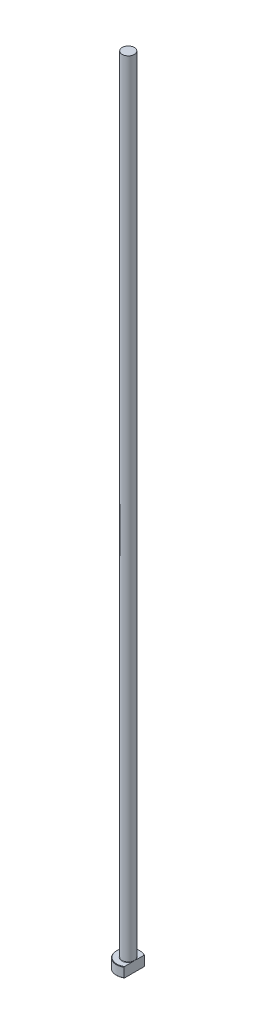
ISO-10303-21;
HEADER;
FILE_DESCRIPTION(('STEP AP214'),'2;1');
FILE_NAME('part.step','',(''),(''),'','','');
FILE_SCHEMA(('AUTOMOTIVE_DESIGN { 1 0 10303 214 1 1 1 1 }'));
ENDSEC;
DATA;
#1=APPLICATION_CONTEXT('core data for automotive mechanical design processes');
#2=APPLICATION_PROTOCOL_DEFINITION('international standard','automotive_design',2000,#1);
#3=PRODUCT_CONTEXT('',#1,'mechanical');
#4=PRODUCT('Part','Part','',(#3));
#5=PRODUCT_RELATED_PRODUCT_CATEGORY('part','',(#4));
#6=PRODUCT_DEFINITION_FORMATION('','',#4);
#7=PRODUCT_DEFINITION_CONTEXT('part definition',#1,'design');
#8=PRODUCT_DEFINITION('design','',#6,#7);
#9=PRODUCT_DEFINITION_SHAPE('','',#8);
#10=(LENGTH_UNIT() NAMED_UNIT(*) SI_UNIT(.MILLI.,.METRE.));
#11=(NAMED_UNIT(*) PLANE_ANGLE_UNIT() SI_UNIT($,.RADIAN.));
#12=(NAMED_UNIT(*) SI_UNIT($,.STERADIAN.) SOLID_ANGLE_UNIT());
#13=UNCERTAINTY_MEASURE_WITH_UNIT(LENGTH_MEASURE(1.E-05),#10,'distance_accuracy_value','');
#14=(GEOMETRIC_REPRESENTATION_CONTEXT(3) GLOBAL_UNCERTAINTY_ASSIGNED_CONTEXT((#13)) GLOBAL_UNIT_ASSIGNED_CONTEXT((#10,
#11,#12)) REPRESENTATION_CONTEXT('',''));
#15=CARTESIAN_POINT('',(0.,0.,0.));
#16=DIRECTION('',(0.,0.,1.));
#17=DIRECTION('',(1.,0.,0.));
#18=AXIS2_PLACEMENT_3D('',#15,#16,#17);
#19=CARTESIAN_POINT('',(0.,0.,0.));
#20=DIRECTION('',(0.,-1.,0.));
#21=DIRECTION('',(0.,0.,-1.));
#22=AXIS2_PLACEMENT_3D('',#19,#20,#21);
#23=PLANE('',#22);
#24=CARTESIAN_POINT('',(0.,0.,0.));
#25=DIRECTION('',(0.,-1.,0.));
#26=DIRECTION('',(0.,0.,-1.));
#27=AXIS2_PLACEMENT_3D('',#24,#25,#26);
#28=CIRCLE('',#27,5.79999999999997);
#29=CARTESIAN_POINT('',(3.04999999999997,0.,4.93330518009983));
#30=VERTEX_POINT('',#29);
#31=CARTESIAN_POINT('',(3.04999999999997,0.,-4.93330518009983));
#32=VERTEX_POINT('',#31);
#33=EDGE_CURVE('E98',#30,#32,#28,.T.);
#34=ORIENTED_EDGE('',*,*,#33,.T.);
#35=DIRECTION('',(0.,0.,1.));
#36=VECTOR('',#35,1.);
#37=CARTESIAN_POINT('',(3.04999999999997,0.,-5.16696235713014));
#38=LINE('',#37,#36);
#39=EDGE_CURVE('E83',#32,#30,#38,.T.);
#40=ORIENTED_EDGE('',*,*,#39,.T.);
#41=EDGE_LOOP('',(#34,#40));
#42=FACE_BOUND('',#41,.T.);
#43=ADVANCED_FACE('F32',(#42),#23,.T.);
#44=CARTESIAN_POINT('',(0.,259.958771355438,0.));
#45=DIRECTION('',(0.,1.,0.));
#46=DIRECTION('',(0.,0.,1.));
#47=AXIS2_PLACEMENT_3D('',#44,#45,#46);
#48=CYLINDRICAL_SURFACE('',#47,5.99999999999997);
#49=CARTESIAN_POINT('',(0.,4.80000000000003,0.));
#50=DIRECTION('',(0.,1.,0.));
#51=DIRECTION('',(0.,0.,1.));
#52=AXIS2_PLACEMENT_3D('',#49,#50,#51);
#53=CIRCLE('',#52,5.99999999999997);
#54=CARTESIAN_POINT('',(3.04999999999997,4.80000000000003,5.16696235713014));
#55=VERTEX_POINT('',#54);
#56=CARTESIAN_POINT('',(3.04999999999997,4.80000000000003,-5.16696235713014));
#57=VERTEX_POINT('',#56);
#58=EDGE_CURVE('E104',#55,#57,#53,.F.);
#59=ORIENTED_EDGE('',*,*,#58,.T.);
#60=DIRECTION('',(0.,-1.,0.));
#61=VECTOR('',#60,1.);
#62=CARTESIAN_POINT('',(3.04999999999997,400.,-5.16696235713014));
#63=LINE('',#62,#61);
#64=CARTESIAN_POINT('',(3.04999999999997,0.199999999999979,-5.16696235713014));
#65=VERTEX_POINT('',#64);
#66=EDGE_CURVE('E183',#57,#65,#63,.T.);
#67=ORIENTED_EDGE('',*,*,#66,.T.);
#68=CARTESIAN_POINT('',(0.,0.199999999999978,0.));
#69=DIRECTION('',(0.,-1.,0.));
#70=DIRECTION('',(0.,0.,-1.));
#71=AXIS2_PLACEMENT_3D('',#68,#69,#70);
#72=CIRCLE('',#71,5.99999999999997);
#73=CARTESIAN_POINT('',(3.04999999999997,0.199999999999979,5.16696235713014));
#74=VERTEX_POINT('',#73);
#75=EDGE_CURVE('E100',#65,#74,#72,.F.);
#76=ORIENTED_EDGE('',*,*,#75,.T.);
#77=DIRECTION('',(0.,-1.,0.));
#78=VECTOR('',#77,1.);
#79=CARTESIAN_POINT('',(3.04999999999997,400.,5.16696235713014));
#80=LINE('',#79,#78);
#81=EDGE_CURVE('E93',#55,#74,#80,.T.);
#82=ORIENTED_EDGE('',*,*,#81,.F.);
#83=EDGE_LOOP('',(#59,#67,#76,#82));
#84=FACE_BOUND('',#83,.T.);
#85=ADVANCED_FACE('F158',(#84),#48,.T.);
#86=CARTESIAN_POINT('',(-5.99999999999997,5.,0.));
#87=DIRECTION('',(0.,1.,0.));
#88=DIRECTION('',(0.,0.,1.));
#89=AXIS2_PLACEMENT_3D('',#86,#87,#88);
#90=PLANE('',#89);
#91=CARTESIAN_POINT('',(0.,5.,0.));
#92=DIRECTION('',(0.,1.,0.));
#93=DIRECTION('',(0.,0.,1.));
#94=AXIS2_PLACEMENT_3D('',#91,#92,#93);
#95=CIRCLE('',#94,5.79999999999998);
#96=CARTESIAN_POINT('',(3.04999999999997,5.,-4.93330518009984));
#97=VERTEX_POINT('',#96);
#98=CARTESIAN_POINT('',(3.04999999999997,5.,4.93330518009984));
#99=VERTEX_POINT('',#98);
#100=EDGE_CURVE('E178',#97,#99,#95,.T.);
#101=ORIENTED_EDGE('',*,*,#100,.T.);
#102=DIRECTION('',(0.,0.,-1.));
#103=VECTOR('',#102,1.);
#104=CARTESIAN_POINT('',(3.04999999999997,5.,0.));
#105=LINE('',#104,#103);
#106=CARTESIAN_POINT('',(3.04999999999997,4.99999999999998,1.12249721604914));
#107=VERTEX_POINT('',#106);
#108=EDGE_CURVE('E57',#99,#107,#105,.T.);
#109=ORIENTED_EDGE('',*,*,#108,.T.);
#110=CARTESIAN_POINT('',(0.,5.,0.));
#111=DIRECTION('',(0.,1.,0.));
#112=DIRECTION('',(0.,0.,1.));
#113=AXIS2_PLACEMENT_3D('',#110,#111,#112);
#114=CIRCLE('',#113,3.24999999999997);
#115=CARTESIAN_POINT('',(3.04999999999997,4.99999999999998,-1.12249721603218));
#116=VERTEX_POINT('',#115);
#117=EDGE_CURVE('E107',#107,#116,#114,.F.);
#118=ORIENTED_EDGE('',*,*,#117,.T.);
#119=EDGE_CURVE('E136',#116,#97,#105,.T.);
#120=ORIENTED_EDGE('',*,*,#119,.T.);
#121=EDGE_LOOP('',(#101,#109,#118,#120));
#122=FACE_BOUND('',#121,.T.);
#123=ADVANCED_FACE('F147',(#122),#90,.T.);
#124=CARTESIAN_POINT('',(0.,5.,0.));
#125=DIRECTION('',(0.,-1.,0.));
#126=DIRECTION('',(0.,0.,-1.));
#127=AXIS2_PLACEMENT_3D('',#124,#125,#126);
#128=CONICAL_SURFACE('',#127,5.79999999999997,0.785398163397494);
#129=ORIENTED_EDGE('',*,*,#58,.F.);
#130=CARTESIAN_POINT('',(3.04999999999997,-0.970698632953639,11.3686783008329));
#131=CARTESIAN_POINT('',(3.04999999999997,-0.729844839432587,11.1192942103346));
#132=CARTESIAN_POINT('',(3.04999999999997,-0.489253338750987,10.8696559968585));
#133=CARTESIAN_POINT('',(3.04999999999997,-0.00874272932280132,10.3697279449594));
#134=CARTESIAN_POINT('',(3.04999999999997,0.231176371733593,10.1194380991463));
#135=CARTESIAN_POINT('',(3.04999999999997,0.71029504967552,9.61795795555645));
#136=CARTESIAN_POINT('',(3.04999999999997,0.949494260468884,9.36676730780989));
#137=CARTESIAN_POINT('',(3.04999999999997,1.42684960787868,8.86339876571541));
#138=CARTESIAN_POINT('',(3.04999999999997,1.66500575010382,8.61122087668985));
#139=CARTESIAN_POINT('',(3.04999999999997,2.13559657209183,8.1102790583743));
#140=CARTESIAN_POINT('',(3.04999999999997,2.36805568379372,7.86153809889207));
#141=CARTESIAN_POINT('',(3.04999999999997,2.83129526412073,7.36249846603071));
#142=CARTESIAN_POINT('',(3.04999999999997,3.0620757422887,7.11219980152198));
#143=CARTESIAN_POINT('',(3.04999999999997,3.52134632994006,6.60959354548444));
#144=CARTESIAN_POINT('',(3.04999999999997,3.74983686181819,6.35728634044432));
#145=CARTESIAN_POINT('',(3.04999999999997,4.20371775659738,5.84990299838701));
#146=CARTESIAN_POINT('',(3.04999999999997,4.42910822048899,5.5948269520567));
#147=CARTESIAN_POINT('',(3.04999999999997,4.79887807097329,5.16894007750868));
#148=CARTESIAN_POINT('',(3.04999999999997,4.94452846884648,4.99923427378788));
#149=CARTESIAN_POINT('',(3.04999999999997,5.23331494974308,4.65766279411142));
#150=CARTESIAN_POINT('',(3.04999999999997,5.37645078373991,4.48579690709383));
#151=CARTESIAN_POINT('',(3.04999999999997,5.6607909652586,4.1375355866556));
#152=CARTESIAN_POINT('',(3.04999999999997,5.80196080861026,3.96111185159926));
#153=CARTESIAN_POINT('',(3.04999999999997,6.07950752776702,3.60459087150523));
#154=CARTESIAN_POINT('',(3.04999999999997,6.21588558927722,3.42449455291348));
#155=CARTESIAN_POINT('',(3.04999999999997,6.48382052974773,3.05665019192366));
#156=CARTESIAN_POINT('',(3.04999999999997,6.61527833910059,2.86882893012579));
#157=CARTESIAN_POINT('',(3.04999999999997,6.8046656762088,2.58172885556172));
#158=CARTESIAN_POINT('',(3.04999999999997,6.86653995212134,2.48505688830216));
#159=CARTESIAN_POINT('',(3.04999999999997,6.98697221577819,2.28967595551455));
#160=CARTESIAN_POINT('',(3.04999999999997,7.04553056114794,2.19096721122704));
#161=CARTESIAN_POINT('',(3.04999999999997,7.1578414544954,1.99234566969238));
#162=CARTESIAN_POINT('',(3.04999999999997,7.21164228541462,1.89246054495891));
#163=CARTESIAN_POINT('',(3.04999999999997,7.31412145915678,1.69011096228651));
#164=CARTESIAN_POINT('',(3.04999999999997,7.36279884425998,1.58764602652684));
#165=CARTESIAN_POINT('',(3.04999999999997,7.498910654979,1.27646394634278));
#166=CARTESIAN_POINT('',(3.04999999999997,7.57686498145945,1.06321933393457));
#167=CARTESIAN_POINT('',(3.04999999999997,7.66214701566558,0.74370706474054));
#168=CARTESIAN_POINT('',(3.04999999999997,7.68491750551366,0.641524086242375));
#169=CARTESIAN_POINT('',(3.04999999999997,7.72074349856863,0.435432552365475));
#170=CARTESIAN_POINT('',(3.04999999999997,7.73379998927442,0.331524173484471));
#171=CARTESIAN_POINT('',(3.04999999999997,7.74926869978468,0.123282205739));
#172=CARTESIAN_POINT('',(3.04999999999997,7.75171909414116,0.0189514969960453));
#173=CARTESIAN_POINT('',(3.04999999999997,7.7458996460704,-0.189412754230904));
#174=CARTESIAN_POINT('',(3.04999999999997,7.73762904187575,-0.293446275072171));
#175=CARTESIAN_POINT('',(3.04999999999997,7.71106535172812,-0.499372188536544));
#176=CARTESIAN_POINT('',(3.04999999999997,7.6928510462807,-0.60127495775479));
#177=CARTESIAN_POINT('',(3.04999999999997,7.64758004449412,-0.803076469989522));
#178=CARTESIAN_POINT('',(3.04999999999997,7.62052218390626,-0.902974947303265));
#179=CARTESIAN_POINT('',(3.04999999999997,7.55873377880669,-1.10100969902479));
#180=CARTESIAN_POINT('',(3.04999999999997,7.52395724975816,-1.19913143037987));
#181=CARTESIAN_POINT('',(3.04999999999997,7.44818034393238,-1.39288710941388));
#182=CARTESIAN_POINT('',(3.04999999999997,7.40718118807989,-1.48852154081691));
#183=CARTESIAN_POINT('',(3.04999999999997,7.27880199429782,-1.76725558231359));
#184=CARTESIAN_POINT('',(3.04999999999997,7.18437453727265,-1.94709912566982));
#185=CARTESIAN_POINT('',(3.04999999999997,6.9829288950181,-2.29966178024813));
#186=CARTESIAN_POINT('',(3.04999999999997,6.87589523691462,-2.47237177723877));
#187=CARTESIAN_POINT('',(3.04999999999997,6.65293850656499,-2.81286471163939));
#188=CARTESIAN_POINT('',(3.04999999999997,6.53698257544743,-2.9806259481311));
#189=CARTESIAN_POINT('',(3.04999999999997,6.29920889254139,-3.31177740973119));
#190=CARTESIAN_POINT('',(3.04999999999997,6.17739401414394,-3.47516971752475));
#191=CARTESIAN_POINT('',(3.04999999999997,5.9279048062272,-3.80077365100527));
#192=CARTESIAN_POINT('',(3.04999999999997,5.80017502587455,-3.96294258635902));
#193=CARTESIAN_POINT('',(3.04999999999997,5.54148279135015,-4.28469855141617));
#194=CARTESIAN_POINT('',(3.04999999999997,5.41052000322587,-4.44428531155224));
#195=CARTESIAN_POINT('',(3.04999999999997,5.14647056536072,-4.76104235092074));
#196=CARTESIAN_POINT('',(3.04999999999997,5.01338972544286,-4.91821748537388));
#197=CARTESIAN_POINT('',(3.04999999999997,4.74534141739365,-5.23095234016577));
#198=CARTESIAN_POINT('',(3.04999999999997,4.61037391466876,-5.3865120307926));
#199=CARTESIAN_POINT('',(3.04999999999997,4.25119607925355,-5.7965100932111));
#200=CARTESIAN_POINT('',(3.04999999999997,4.02571738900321,-6.04983649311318));
#201=CARTESIAN_POINT('',(3.04999999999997,3.57194090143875,-6.55395552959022));
#202=CARTESIAN_POINT('',(3.04999999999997,3.34364302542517,-6.80474809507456));
#203=CARTESIAN_POINT('',(3.04999999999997,2.88477169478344,-7.30466840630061));
#204=CARTESIAN_POINT('',(3.04999999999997,2.65419632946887,-7.55379439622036));
#205=CARTESIAN_POINT('',(3.04999999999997,2.19148976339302,-8.05059711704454));
#206=CARTESIAN_POINT('',(3.04999999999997,1.9593585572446,-8.29827384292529));
#207=CARTESIAN_POINT('',(3.04999999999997,1.50341144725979,-8.78239136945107));
#208=CARTESIAN_POINT('',(3.04999999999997,1.27964364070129,-9.01887750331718));
#209=CARTESIAN_POINT('',(3.04999999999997,0.831227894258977,-9.49101521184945));
#210=CARTESIAN_POINT('',(3.04999999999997,0.606579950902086,-9.72666678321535));
#211=CARTESIAN_POINT('',(3.04999999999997,0.156823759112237,-10.1970312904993));
#212=CARTESIAN_POINT('',(3.04999999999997,-0.0682837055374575,-10.431744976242));
#213=CARTESIAN_POINT('',(3.04999999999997,-0.519082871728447,-10.9006068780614));
#214=CARTESIAN_POINT('',(3.04999999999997,-0.744774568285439,-11.1347550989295));
#215=CARTESIAN_POINT('',(3.04999999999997,-0.970698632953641,-11.3686783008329));
#216=B_SPLINE_CURVE_WITH_KNOTS('',3,(#130,#131,#132,#133,#134,#135,#136,#137,#138,#139,#140,
#141,#142,#143,#144,#145,#146,#147,#148,#149,#150,#151,#152,#153,#154,#155,#156,#157,#158,#159,
#160,#161,#162,#163,#164,#165,#166,#167,#168,#169,#170,#171,#172,#173,#174,#175,#176,#177,#178,
#179,#180,#181,#182,#183,#184,#185,#186,#187,#188,#189,#190,#191,#192,#193,#194,#195,#196,#197,
#198,#199,#200,#201,#202,#203,#204,#205,#206,#207,#208,#209,#210,#211,#212,#213,#214,#215),
.UNSPECIFIED.,.F.,.F.,(4,2,2,2,2,2,2,2,2,2,2,2,2,2,2,2,2,2,2,2,2,2,2,2,2,2,2,2,2,2,2,2,2,2,2,2,
2,2,2,2,2,2,4),(0.,1.04010969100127,2.08023122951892,3.120813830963,4.16139083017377,
5.1827488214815,6.20410100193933,7.22526118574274,8.24638802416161,8.9172846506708,
9.58824734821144,10.2660415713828,10.9436668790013,11.6311554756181,11.9754354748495,
12.3196782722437,12.6598862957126,13.0001578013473,13.6781281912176,13.9918165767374,
14.3054730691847,14.6179996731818,14.9305484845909,15.2406562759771,15.5508049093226,
15.8628533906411,16.1748407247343,16.7833414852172,17.3925970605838,18.0042149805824,
18.6155359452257,19.2347734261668,19.8540751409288,20.4718999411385,21.0897360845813,
22.1071178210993,23.1245280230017,24.1428799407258,25.1612353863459,26.137951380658,
27.1146712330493,28.0903109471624,29.0659423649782),.UNSPECIFIED.);
#217=EDGE_CURVE('E135',#55,#99,#216,.T.);
#218=ORIENTED_EDGE('',*,*,#217,.T.);
#219=ORIENTED_EDGE('',*,*,#100,.F.);
#220=EDGE_CURVE('E127',#97,#57,#216,.T.);
#221=ORIENTED_EDGE('',*,*,#220,.T.);
#222=EDGE_LOOP('',(#129,#218,#219,#221));
#223=FACE_BOUND('',#222,.T.);
#224=ADVANCED_FACE('F143',(#223),#128,.T.);
#225=CARTESIAN_POINT('',(0.,0.199999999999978,0.));
#226=DIRECTION('',(0.,1.,0.));
#227=DIRECTION('',(0.,0.,1.));
#228=AXIS2_PLACEMENT_3D('',#225,#226,#227);
#229=CONICAL_SURFACE('',#228,5.99999999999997,0.785398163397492);
#230=ORIENTED_EDGE('',*,*,#75,.F.);
#231=CARTESIAN_POINT('',(3.04999999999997,5.97069863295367,-11.3686783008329));
#232=CARTESIAN_POINT('',(3.04999999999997,5.72984483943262,-11.1192942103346));
#233=CARTESIAN_POINT('',(3.04999999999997,5.48925333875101,-10.8696559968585));
#234=CARTESIAN_POINT('',(3.04999999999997,5.00874272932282,-10.3697279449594));
#235=CARTESIAN_POINT('',(3.04999999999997,4.76882362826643,-10.1194380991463));
#236=CARTESIAN_POINT('',(3.04999999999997,4.28970495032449,-9.61795795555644));
#237=CARTESIAN_POINT('',(3.04999999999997,4.05050573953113,-9.36676730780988));
#238=CARTESIAN_POINT('',(3.04999999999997,3.57315039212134,-8.8633987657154));
#239=CARTESIAN_POINT('',(3.04999999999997,3.33499424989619,-8.61122087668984));
#240=CARTESIAN_POINT('',(3.04999999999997,2.86440342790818,-8.11027905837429));
#241=CARTESIAN_POINT('',(3.04999999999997,2.63194431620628,-7.86153809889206));
#242=CARTESIAN_POINT('',(3.04999999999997,2.16870473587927,-7.36249846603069));
#243=CARTESIAN_POINT('',(3.04999999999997,1.9379242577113,-7.11219980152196));
#244=CARTESIAN_POINT('',(3.04999999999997,1.47865367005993,-6.60959354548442));
#245=CARTESIAN_POINT('',(3.04999999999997,1.25016313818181,-6.3572863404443));
#246=CARTESIAN_POINT('',(3.04999999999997,0.796282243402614,-5.84990299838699));
#247=CARTESIAN_POINT('',(3.04999999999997,0.570891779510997,-5.59482695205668));
#248=CARTESIAN_POINT('',(3.04999999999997,0.201121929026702,-5.16894007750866));
#249=CARTESIAN_POINT('',(3.04999999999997,0.0554715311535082,-4.99923427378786));
#250=CARTESIAN_POINT('',(3.04999999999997,-0.233314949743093,-4.65766279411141));
#251=CARTESIAN_POINT('',(3.04999999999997,-0.376450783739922,-4.48579690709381));
#252=CARTESIAN_POINT('',(3.04999999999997,-0.660790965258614,-4.13753558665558));
#253=CARTESIAN_POINT('',(3.04999999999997,-0.801960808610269,-3.96111185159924));
#254=CARTESIAN_POINT('',(3.04999999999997,-1.07950752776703,-3.60459087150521));
#255=CARTESIAN_POINT('',(3.04999999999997,-1.21588558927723,-3.42449455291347));
#256=CARTESIAN_POINT('',(3.04999999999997,-1.48382052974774,-3.05665019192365));
#257=CARTESIAN_POINT('',(3.04999999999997,-1.6152783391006,-2.86882893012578));
#258=CARTESIAN_POINT('',(3.04999999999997,-1.80466567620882,-2.58172885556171));
#259=CARTESIAN_POINT('',(3.04999999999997,-1.86653995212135,-2.48505688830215));
#260=CARTESIAN_POINT('',(3.04999999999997,-1.9869722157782,-2.28967595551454));
#261=CARTESIAN_POINT('',(3.04999999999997,-2.04553056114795,-2.19096721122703));
#262=CARTESIAN_POINT('',(3.04999999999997,-2.15784145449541,-1.99234566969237));
#263=CARTESIAN_POINT('',(3.04999999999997,-2.21164228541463,-1.8924605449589));
#264=CARTESIAN_POINT('',(3.04999999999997,-2.31412145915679,-1.6901109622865));
#265=CARTESIAN_POINT('',(3.04999999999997,-2.36279884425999,-1.58764602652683));
#266=CARTESIAN_POINT('',(3.04999999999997,-2.49891065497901,-1.27646394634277));
#267=CARTESIAN_POINT('',(3.04999999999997,-2.57686498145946,-1.06321933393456));
#268=CARTESIAN_POINT('',(3.04999999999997,-2.66214701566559,-0.743707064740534));
#269=CARTESIAN_POINT('',(3.04999999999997,-2.68491750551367,-0.641524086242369));
#270=CARTESIAN_POINT('',(3.04999999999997,-2.72074349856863,-0.43543255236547));
#271=CARTESIAN_POINT('',(3.04999999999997,-2.73379998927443,-0.331524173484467));
#272=CARTESIAN_POINT('',(3.04999999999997,-2.74926869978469,-0.123282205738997));
#273=CARTESIAN_POINT('',(3.04999999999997,-2.75171909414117,-0.0189514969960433));
#274=CARTESIAN_POINT('',(3.04999999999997,-2.74589964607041,0.189412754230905));
#275=CARTESIAN_POINT('',(3.04999999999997,-2.73762904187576,0.293446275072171));
#276=CARTESIAN_POINT('',(3.04999999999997,-2.71106535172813,0.499372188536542));
#277=CARTESIAN_POINT('',(3.04999999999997,-2.69285104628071,0.601274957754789));
#278=CARTESIAN_POINT('',(3.04999999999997,-2.64758004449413,0.803076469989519));
#279=CARTESIAN_POINT('',(3.04999999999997,-2.62052218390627,0.902974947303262));
#280=CARTESIAN_POINT('',(3.04999999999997,-2.5587337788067,1.10100969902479));
#281=CARTESIAN_POINT('',(3.04999999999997,-2.52395724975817,1.19913143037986));
#282=CARTESIAN_POINT('',(3.04999999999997,-2.44818034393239,1.39288710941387));
#283=CARTESIAN_POINT('',(3.04999999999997,-2.4071811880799,1.4885215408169));
#284=CARTESIAN_POINT('',(3.04999999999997,-2.27880199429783,1.76725558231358));
#285=CARTESIAN_POINT('',(3.04999999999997,-2.18437453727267,1.9470991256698));
#286=CARTESIAN_POINT('',(3.04999999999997,-1.98292889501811,2.29966178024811));
#287=CARTESIAN_POINT('',(3.04999999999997,-1.87589523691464,2.47237177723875));
#288=CARTESIAN_POINT('',(3.04999999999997,-1.65293850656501,2.81286471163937));
#289=CARTESIAN_POINT('',(3.04999999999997,-1.53698257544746,2.98062594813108));
#290=CARTESIAN_POINT('',(3.04999999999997,-1.29920889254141,3.31177740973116));
#291=CARTESIAN_POINT('',(3.04999999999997,-1.17739401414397,3.47516971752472));
#292=CARTESIAN_POINT('',(3.04999999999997,-0.927904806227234,3.80077365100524));
#293=CARTESIAN_POINT('',(3.04999999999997,-0.800175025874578,3.96294258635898));
#294=CARTESIAN_POINT('',(3.04999999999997,-0.541482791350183,4.28469855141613));
#295=CARTESIAN_POINT('',(3.04999999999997,-0.410520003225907,4.4442853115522));
#296=CARTESIAN_POINT('',(3.04999999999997,-0.146470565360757,4.76104235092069));
#297=CARTESIAN_POINT('',(3.04999999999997,-0.0133897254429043,4.91821748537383));
#298=CARTESIAN_POINT('',(3.04999999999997,0.254658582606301,5.23095234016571));
#299=CARTESIAN_POINT('',(3.04999999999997,0.389626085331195,5.38651203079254));
#300=CARTESIAN_POINT('',(3.04999999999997,0.748803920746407,5.79651009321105));
#301=CARTESIAN_POINT('',(3.04999999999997,0.97428261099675,6.04983649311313));
#302=CARTESIAN_POINT('',(3.04999999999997,1.42805909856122,6.55395552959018));
#303=CARTESIAN_POINT('',(3.04999999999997,1.6563569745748,6.80474809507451));
#304=CARTESIAN_POINT('',(3.04999999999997,2.11522830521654,7.30466840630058));
#305=CARTESIAN_POINT('',(3.04999999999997,2.34580367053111,7.55379439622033));
#306=CARTESIAN_POINT('',(3.04999999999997,2.80851023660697,8.05059711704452));
#307=CARTESIAN_POINT('',(3.04999999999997,3.0406414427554,8.29827384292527));
#308=CARTESIAN_POINT('',(3.04999999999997,3.49658855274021,8.78239136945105));
#309=CARTESIAN_POINT('',(3.04999999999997,3.72035635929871,9.01887750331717));
#310=CARTESIAN_POINT('',(3.04999999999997,4.16877210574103,9.49101521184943));
#311=CARTESIAN_POINT('',(3.04999999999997,4.39342004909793,9.72666678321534));
#312=CARTESIAN_POINT('',(3.04999999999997,4.84317624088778,10.1970312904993));
#313=CARTESIAN_POINT('',(3.04999999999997,5.06828370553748,10.431744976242));
#314=CARTESIAN_POINT('',(3.04999999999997,5.51908287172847,10.9006068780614));
#315=CARTESIAN_POINT('',(3.04999999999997,5.74477456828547,11.1347550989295));
#316=CARTESIAN_POINT('',(3.04999999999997,5.97069863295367,11.3686783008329));
#317=B_SPLINE_CURVE_WITH_KNOTS('',3,(#231,#232,#233,#234,#235,#236,#237,#238,#239,#240,#241,
#242,#243,#244,#245,#246,#247,#248,#249,#250,#251,#252,#253,#254,#255,#256,#257,#258,#259,#260,
#261,#262,#263,#264,#265,#266,#267,#268,#269,#270,#271,#272,#273,#274,#275,#276,#277,#278,#279,
#280,#281,#282,#283,#284,#285,#286,#287,#288,#289,#290,#291,#292,#293,#294,#295,#296,#297,#298,
#299,#300,#301,#302,#303,#304,#305,#306,#307,#308,#309,#310,#311,#312,#313,#314,#315,#316),
.UNSPECIFIED.,.F.,.F.,(4,2,2,2,2,2,2,2,2,2,2,2,2,2,2,2,2,2,2,2,2,2,2,2,2,2,2,2,2,2,2,2,2,2,2,2,
2,2,2,2,2,2,4),(0.,1.04010969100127,2.08023122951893,3.12081383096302,4.1613908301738,
5.18274882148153,6.20410100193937,7.22526118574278,8.24638802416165,8.91728465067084,
9.58824734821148,10.2660415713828,10.9436668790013,11.6311554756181,11.9754354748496,
12.3196782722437,12.6598862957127,13.0001578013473,13.6781281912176,13.9918165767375,
14.3054730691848,14.6179996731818,14.930548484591,15.2406562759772,15.5508049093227,
15.8628533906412,16.1748407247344,16.7833414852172,17.3925970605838,18.0042149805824,
18.6155359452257,19.2347734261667,19.8540751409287,20.4718999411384,21.0897360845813,
22.1071178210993,23.1245280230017,24.1428799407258,25.1612353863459,26.137951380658,
27.1146712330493,28.0903109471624,29.0659423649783),.UNSPECIFIED.);
#318=EDGE_CURVE('E86',#65,#32,#317,.T.);
#319=ORIENTED_EDGE('',*,*,#318,.T.);
#320=ORIENTED_EDGE('',*,*,#33,.F.);
#321=EDGE_CURVE('E89',#30,#74,#317,.T.);
#322=ORIENTED_EDGE('',*,*,#321,.T.);
#323=EDGE_LOOP('',(#230,#319,#320,#322));
#324=FACE_BOUND('',#323,.T.);
#325=ADVANCED_FACE('F97',(#324),#229,.T.);
#326=CARTESIAN_POINT('',(0.,5.19999999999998,0.));
#327=DIRECTION('',(0.,1.,0.));
#328=DIRECTION('',(0.,0.,1.));
#329=AXIS2_PLACEMENT_3D('',#326,#327,#328);
#330=TOROIDAL_SURFACE('',#329,3.24999999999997,0.2);
#331=CARTESIAN_POINT('',(3.04999999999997,5.19999999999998,0.));
#332=CARTESIAN_POINT('',(3.04999999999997,5.20000050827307,1.21234498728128E-10));
#333=CARTESIAN_POINT('',(3.04999999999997,5.2000010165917,-1.94554167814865E-07));
#334=CARTESIAN_POINT('',(3.04999999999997,5.20000196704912,-7.36231908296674E-07));
#335=CARTESIAN_POINT('',(3.04999999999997,5.20000239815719,-1.09605845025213E-06));
#336=CARTESIAN_POINT('',(3.04999999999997,5.20000329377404,-1.95768484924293E-06));
#337=CARTESIAN_POINT('',(3.04999999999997,5.20000374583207,-2.47339958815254E-06));
#338=CARTESIAN_POINT('',(3.04999999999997,5.20000455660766,-3.54344299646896E-06));
#339=CARTESIAN_POINT('',(3.04999999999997,5.20000491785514,-4.0960013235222E-06));
#340=CARTESIAN_POINT('',(3.04999999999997,5.20000625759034,-6.23288240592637E-06));
#341=CARTESIAN_POINT('',(3.04999999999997,5.20000716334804,-7.86540857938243E-06));
#342=CARTESIAN_POINT('',(3.04999999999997,5.20000865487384,-1.11012618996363E-05));
#343=CARTESIAN_POINT('',(3.04999999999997,5.20000926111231,-1.26955485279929E-05));
#344=CARTESIAN_POINT('',(3.04999999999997,5.20001180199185,-1.94350330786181E-05));
#345=CARTESIAN_POINT('',(3.04999999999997,5.20001369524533,-2.45990996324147E-05));
#346=CARTESIAN_POINT('',(3.04999999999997,5.20001648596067,-3.43608245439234E-05));
#347=CARTESIAN_POINT('',(3.04999999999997,5.20001748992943,-3.892785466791E-05));
#348=CARTESIAN_POINT('',(3.04999999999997,5.20002479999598,-7.28490938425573E-05));
#349=CARTESIAN_POINT('',(3.04999999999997,5.20003033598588,-0.000102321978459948));
#350=CARTESIAN_POINT('',(3.04999999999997,5.2000545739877,-0.000218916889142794));
#351=CARTESIAN_POINT('',(3.04999999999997,5.20007771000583,-0.000305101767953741));
#352=CARTESIAN_POINT('',(3.04999999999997,5.20016793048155,-0.000646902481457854));
#353=CARTESIAN_POINT('',(3.04999999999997,5.20023214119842,-0.00090303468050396));
#354=CARTESIAN_POINT('',(3.04999999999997,5.20048959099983,-0.00192235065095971));
#355=CARTESIAN_POINT('',(3.04999999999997,5.200686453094,-0.00268486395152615));
#356=CARTESIAN_POINT('',(3.04999999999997,5.20150513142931,-0.0058644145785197));
#357=CARTESIAN_POINT('',(3.04999999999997,5.20212238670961,-0.00828229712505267));
#358=CARTESIAN_POINT('',(3.04999999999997,5.20733075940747,-0.0286735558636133));
#359=CARTESIAN_POINT('',(3.04999999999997,5.21193872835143,-0.0466439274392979));
#360=CARTESIAN_POINT('',(3.04999999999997,5.22094200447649,-0.0818758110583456));
#361=CARTESIAN_POINT('',(3.04999999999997,5.22533847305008,-0.0991370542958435));
#362=CARTESIAN_POINT('',(3.04999999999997,5.23964641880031,-0.155525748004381));
#363=CARTESIAN_POINT('',(3.04999999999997,5.24949334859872,-0.194669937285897));
#364=CARTESIAN_POINT('',(3.04999999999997,5.26604342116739,-0.261710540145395));
#365=CARTESIAN_POINT('',(3.04999999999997,5.27283214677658,-0.289585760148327));
#366=CARTESIAN_POINT('',(3.04999999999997,5.28599220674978,-0.344649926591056));
#367=CARTESIAN_POINT('',(3.04999999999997,5.29236984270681,-0.371837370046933));
#368=CARTESIAN_POINT('',(3.04999999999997,5.31157589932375,-0.455723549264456));
#369=CARTESIAN_POINT('',(3.04999999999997,5.32392035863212,-0.512535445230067));
#370=CARTESIAN_POINT('',(3.04999999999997,5.34680977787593,-0.627095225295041));
#371=CARTESIAN_POINT('',(3.04999999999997,5.35733631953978,-0.684846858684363));
#372=CARTESIAN_POINT('',(3.04999999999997,5.37641100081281,-0.805890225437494));
#373=CARTESIAN_POINT('',(3.04999999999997,5.38470472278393,-0.869223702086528));
#374=CARTESIAN_POINT('',(3.04999999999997,5.39650442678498,-0.996147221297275));
#375=CARTESIAN_POINT('',(3.04999999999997,5.40002782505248,-1.05973547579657));
#376=CARTESIAN_POINT('',(3.04999999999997,5.39997784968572,-1.17309949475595));
#377=CARTESIAN_POINT('',(3.04999999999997,5.39778745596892,-1.22285605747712));
#378=CARTESIAN_POINT('',(3.04999999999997,5.38969143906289,-1.29668621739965));
#379=CARTESIAN_POINT('',(3.04999999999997,5.38622595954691,-1.32101834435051));
#380=CARTESIAN_POINT('',(3.04999999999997,5.37728481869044,-1.36928415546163));
#381=CARTESIAN_POINT('',(3.04999999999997,5.37181197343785,-1.39321834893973));
#382=CARTESIAN_POINT('',(3.04999999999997,5.35809904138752,-1.44077878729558));
#383=CARTESIAN_POINT('',(3.04999999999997,5.34981429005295,-1.46439322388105));
#384=CARTESIAN_POINT('',(3.04999999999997,5.33448033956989,-1.49846738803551));
#385=CARTESIAN_POINT('',(3.04999999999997,5.3288970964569,-1.5095822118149));
#386=CARTESIAN_POINT('',(3.04999999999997,5.3165352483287,-1.53111652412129));
#387=CARTESIAN_POINT('',(3.04999999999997,5.30975936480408,-1.54153752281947));
#388=CARTESIAN_POINT('',(3.04999999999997,5.29649230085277,-1.55894178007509));
#389=CARTESIAN_POINT('',(3.04999999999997,5.29030904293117,-1.56615709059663));
#390=CARTESIAN_POINT('',(3.04999999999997,5.27693406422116,-1.57958549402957));
#391=CARTESIAN_POINT('',(3.04999999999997,5.26974514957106,-1.58580127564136));
#392=CARTESIAN_POINT('',(3.04999999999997,5.25691386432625,-1.5948473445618));
#393=CARTESIAN_POINT('',(3.04999999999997,5.25157849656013,-1.59810970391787));
#394=CARTESIAN_POINT('',(3.04999999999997,5.24045977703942,-1.60376515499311));
#395=CARTESIAN_POINT('',(3.04999999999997,5.23467674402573,-1.60615885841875));
#396=CARTESIAN_POINT('',(3.04999999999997,5.22270107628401,-1.60988393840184));
#397=CARTESIAN_POINT('',(3.04999999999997,5.21650471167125,-1.61120363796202));
#398=CARTESIAN_POINT('',(3.04999999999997,5.2039743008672,-1.61257691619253));
#399=CARTESIAN_POINT('',(3.04999999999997,5.19764039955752,-1.61263176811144));
#400=CARTESIAN_POINT('',(3.04999999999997,5.18599578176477,-1.6115568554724));
#401=CARTESIAN_POINT('',(3.04999999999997,5.18066847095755,-1.61059566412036));
#402=CARTESIAN_POINT('',(3.04999999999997,5.17023814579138,-1.60783192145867));
#403=CARTESIAN_POINT('',(3.04999999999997,5.16513526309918,-1.60602888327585));
#404=CARTESIAN_POINT('',(3.04999999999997,5.1534435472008,-1.60092650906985));
#405=CARTESIAN_POINT('',(3.04999999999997,5.14698890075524,-1.59732150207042));
#406=CARTESIAN_POINT('',(3.04999999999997,5.13473509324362,-1.58913221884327));
#407=CARTESIAN_POINT('',(3.04999999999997,5.12893753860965,-1.58454561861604));
#408=CARTESIAN_POINT('',(3.04999999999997,5.11462865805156,-1.571659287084));
#409=CARTESIAN_POINT('',(3.04999999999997,5.10662306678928,-1.56280289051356));
#410=CARTESIAN_POINT('',(3.04999999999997,5.09200345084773,-1.54403227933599));
#411=CARTESIAN_POINT('',(3.04999999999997,5.08539179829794,-1.53411630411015));
#412=CARTESIAN_POINT('',(3.04999999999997,5.06752820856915,-1.50390051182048));
#413=CARTESIAN_POINT('',(3.04999999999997,5.05783763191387,-1.48268800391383));
#414=CARTESIAN_POINT('',(3.04999999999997,5.04132960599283,-1.43906853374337));
#415=CARTESIAN_POINT('',(3.04999999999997,5.03453663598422,-1.41665312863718));
#416=CARTESIAN_POINT('',(3.04999999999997,5.0206522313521,-1.36141193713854));
#417=CARTESIAN_POINT('',(3.04999999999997,5.01471674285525,-1.32829980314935));
#418=CARTESIAN_POINT('',(3.04999999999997,5.0059927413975,-1.26161040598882));
#419=CARTESIAN_POINT('',(3.04999999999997,5.00321404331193,-1.22803201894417));
#420=CARTESIAN_POINT('',(3.04999999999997,5.00011178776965,-1.16191365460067));
#421=CARTESIAN_POINT('',(3.04999999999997,4.99970809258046,-1.12937711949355));
#422=CARTESIAN_POINT('',(3.04999999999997,5.0006737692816,-1.06450961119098));
#423=CARTESIAN_POINT('',(3.04999999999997,5.00203387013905,-1.03217845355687));
#424=CARTESIAN_POINT('',(3.04999999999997,5.00868972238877,-0.928108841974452));
#425=CARTESIAN_POINT('',(3.04999999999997,5.0167646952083,-0.856551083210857));
#426=CARTESIAN_POINT('',(3.04999999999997,5.03767337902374,-0.712390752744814));
#427=CARTESIAN_POINT('',(3.04999999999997,5.05061983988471,-0.639806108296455));
#428=CARTESIAN_POINT('',(3.04999999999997,5.07500705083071,-0.518012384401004));
#429=CARTESIAN_POINT('',(3.04999999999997,5.08563897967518,-0.468637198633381));
#430=CARTESIAN_POINT('',(3.04999999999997,5.10778639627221,-0.370668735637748));
#431=CARTESIAN_POINT('',(3.04999999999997,5.11929064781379,-0.322072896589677));
#432=CARTESIAN_POINT('',(3.04999999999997,5.14155853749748,-0.230580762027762));
#433=CARTESIAN_POINT('',(3.04999999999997,5.15225641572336,-0.18766821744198));
#434=CARTESIAN_POINT('',(3.04999999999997,5.17439488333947,-0.100070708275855));
#435=CARTESIAN_POINT('',(3.04999999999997,5.18584763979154,-0.0553887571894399));
#436=CARTESIAN_POINT('',(3.04999999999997,5.19787889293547,-0.00827685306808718));
#437=CARTESIAN_POINT('',(3.04999999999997,5.19849761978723,-0.00585356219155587));
#438=CARTESIAN_POINT('',(3.04999999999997,5.19931663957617,-0.00267278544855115));
#439=CARTESIAN_POINT('',(3.04999999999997,5.19951241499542,-0.00191446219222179));
#440=CARTESIAN_POINT('',(3.04999999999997,5.19976854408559,-0.000900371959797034));
#441=CARTESIAN_POINT('',(3.04999999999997,5.19983249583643,-0.000645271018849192));
#442=CARTESIAN_POINT('',(3.04999999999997,5.19992240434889,-0.000304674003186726));
#443=CARTESIAN_POINT('',(3.04999999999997,5.19994549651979,-0.000218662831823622));
#444=CARTESIAN_POINT('',(3.04999999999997,5.19996969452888,-0.000102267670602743));
#445=CARTESIAN_POINT('',(3.04999999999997,5.19997522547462,-7.28190159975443E-05));
#446=CARTESIAN_POINT('',(3.04999999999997,5.19998252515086,-3.89225111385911E-05));
#447=CARTESIAN_POINT('',(3.04999999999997,5.19998352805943,-3.43568150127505E-05));
#448=CARTESIAN_POINT('',(3.04999999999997,5.19998631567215,-2.45978369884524E-05));
#449=CARTESIAN_POINT('',(3.04999999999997,5.1999882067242,-1.94351124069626E-05));
#450=CARTESIAN_POINT('',(3.04999999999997,5.1999907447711,-1.26970231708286E-05));
#451=CARTESIAN_POINT('',(3.04999999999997,5.19999135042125,-1.11028362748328E-05));
#452=CARTESIAN_POINT('',(3.04999999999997,5.1999928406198,-7.86708671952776E-06));
#453=CARTESIAN_POINT('',(3.04999999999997,5.19999374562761,-6.23455192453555E-06));
#454=CARTESIAN_POINT('',(3.04999999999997,5.19999508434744,-4.09754810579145E-06));
#455=CARTESIAN_POINT('',(3.04999999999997,5.19999544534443,-3.54492580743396E-06));
#456=CARTESIAN_POINT('',(3.04999999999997,5.19999625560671,-2.47470923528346E-06));
#457=CARTESIAN_POINT('',(3.04999999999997,5.19999670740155,-1.95888361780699E-06));
#458=CARTESIAN_POINT('',(3.04999999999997,5.19999760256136,-1.0969972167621E-06));
#459=CARTESIAN_POINT('',(3.04999999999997,5.19999803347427,-7.37031479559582E-07));
#460=CARTESIAN_POINT('',(3.04999999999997,5.19999898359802,-1.95001258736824E-07));
#461=CARTESIAN_POINT('',(3.04999999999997,5.19999949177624,-1.21222728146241E-10));
#462=CARTESIAN_POINT('',(3.04999999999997,5.19999999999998,0.));
#463=B_SPLINE_CURVE_WITH_KNOTS('',3,(#331,#332,#333,#334,#335,#336,#337,#338,#339,#340,#341,
#342,#343,#344,#345,#346,#347,#348,#349,#350,#351,#352,#353,#354,#355,#356,#357,#358,#359,#360,
#361,#362,#363,#364,#365,#366,#367,#368,#369,#370,#371,#372,#373,#374,#375,#376,#377,#378,#379,
#380,#381,#382,#383,#384,#385,#386,#387,#388,#389,#390,#391,#392,#393,#394,#395,#396,#397,#398,
#399,#400,#401,#402,#403,#404,#405,#406,#407,#408,#409,#410,#411,#412,#413,#414,#415,#416,#417,
#418,#419,#420,#421,#422,#423,#424,#425,#426,#427,#428,#429,#430,#431,#432,#433,#434,#435,#436,
#437,#438,#439,#440,#441,#442,#443,#444,#445,#446,#447,#448,#449,#450,#451,#452,#453,#454,#455,
#456,#457,#458,#459,#460,#461,#462),.UNSPECIFIED.,.T.,.F.,(4,2,2,2,2,2,2,2,2,2,2,2,2,2,2,2,2,2,
2,2,2,2,2,2,2,2,2,2,2,2,2,2,2,2,2,2,2,2,2,2,2,2,2,2,2,2,2,2,2,2,2,2,2,2,2,2,2,2,2,2,2,2,2,2,2,
4),(0.,1.5382752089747E-06,3.22415721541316E-06,5.2692011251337E-06,7.24861516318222E-06,
1.28291752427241E-05,1.79415577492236E-05,3.44133799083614E-05,4.84245514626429E-05,
0.000138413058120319,0.000405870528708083,0.00119830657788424,0.00356053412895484,
0.0110471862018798,0.0667008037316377,0.120138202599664,0.241228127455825,0.327297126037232,
0.41107297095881,0.585463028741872,0.761527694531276,0.953030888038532,1.14383300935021,
1.29292597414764,1.36659252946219,1.44015613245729,1.51494761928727,1.55221054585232,
1.58938951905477,1.61782336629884,1.64617939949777,1.66487921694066,1.68356584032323,
1.70245301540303,1.72132117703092,1.73748643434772,1.75366105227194,1.77571568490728,
1.7978231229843,1.8334356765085,1.86910835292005,1.93868184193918,2.00883198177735,
2.10950216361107,2.21048449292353,2.30803898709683,2.40508277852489,2.62085310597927,
2.84195966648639,2.99346730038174,3.14327714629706,3.27595462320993,3.41432907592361,
3.4218325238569,3.4241817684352,3.42497101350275,3.42523793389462,3.42532784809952,
3.42534185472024,3.42535832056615,3.42536343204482,3.42536901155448,3.42537099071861,
3.42537303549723,3.4253747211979,3.42537625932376),.UNSPECIFIED.);
#464=CARTESIAN_POINT('',(3.04999999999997,5.19999999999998,0.));
#465=VERTEX_POINT('',#464);
#466=EDGE_CURVE('E11',#116,#465,#463,.T.);
#467=ORIENTED_EDGE('',*,*,#466,.F.);
#468=ORIENTED_EDGE('',*,*,#117,.F.);
#469=CARTESIAN_POINT('',(3.04999999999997,5.19999999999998,0.));
#470=CARTESIAN_POINT('',(3.04999999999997,5.19999949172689,-1.2123455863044E-10));
#471=CARTESIAN_POINT('',(3.04999999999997,5.19999898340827,1.94554167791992E-07));
#472=CARTESIAN_POINT('',(3.04999999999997,5.19999803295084,7.36231908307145E-07));
#473=CARTESIAN_POINT('',(3.04999999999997,5.19999760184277,1.09605845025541E-06));
#474=CARTESIAN_POINT('',(3.04999999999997,5.19999670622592,1.95768484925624E-06));
#475=CARTESIAN_POINT('',(3.04999999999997,5.19999625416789,2.47339958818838E-06));
#476=CARTESIAN_POINT('',(3.04999999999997,5.1999954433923,3.54344299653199E-06));
#477=CARTESIAN_POINT('',(3.04999999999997,5.19999508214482,4.09600132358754E-06));
#478=CARTESIAN_POINT('',(3.04999999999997,5.19999374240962,6.23288240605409E-06));
#479=CARTESIAN_POINT('',(3.04999999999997,5.19999283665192,7.86540857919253E-06));
#480=CARTESIAN_POINT('',(3.04999999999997,5.19999134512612,1.11012618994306E-05));
#481=CARTESIAN_POINT('',(3.04999999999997,5.19999073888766,1.26955485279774E-05));
#482=CARTESIAN_POINT('',(3.04999999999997,5.19998819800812,1.94350330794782E-05));
#483=CARTESIAN_POINT('',(3.04999999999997,5.19998630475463,2.45990996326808E-05));
#484=CARTESIAN_POINT('',(3.04999999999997,5.1999835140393,3.43608245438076E-05));
#485=CARTESIAN_POINT('',(3.04999999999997,5.19998251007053,3.89278546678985E-05));
#486=CARTESIAN_POINT('',(3.04999999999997,5.19997520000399,7.28490938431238E-05));
#487=CARTESIAN_POINT('',(3.04999999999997,5.19996966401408,0.000102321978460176));
#488=CARTESIAN_POINT('',(3.04999999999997,5.19994542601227,0.000218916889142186));
#489=CARTESIAN_POINT('',(3.04999999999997,5.19992228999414,0.000305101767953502));
#490=CARTESIAN_POINT('',(3.04999999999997,5.19983206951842,0.000646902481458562));
#491=CARTESIAN_POINT('',(3.04999999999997,5.19976785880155,0.000903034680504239));
#492=CARTESIAN_POINT('',(3.04999999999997,5.19951040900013,0.00192235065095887));
#493=CARTESIAN_POINT('',(3.04999999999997,5.19931354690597,0.00268486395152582));
#494=CARTESIAN_POINT('',(3.04999999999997,5.19849486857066,0.00586441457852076));
#495=CARTESIAN_POINT('',(3.04999999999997,5.19787761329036,0.00828229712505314));
#496=CARTESIAN_POINT('',(3.04999999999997,5.19266924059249,0.0286735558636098));
#497=CARTESIAN_POINT('',(3.04999999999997,5.18806127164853,0.046643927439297));
#498=CARTESIAN_POINT('',(3.04999999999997,5.17905799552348,0.0818758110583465));
#499=CARTESIAN_POINT('',(3.04999999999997,5.17466152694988,0.0991370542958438));
#500=CARTESIAN_POINT('',(3.04999999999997,5.16035358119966,0.155525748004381));
#501=CARTESIAN_POINT('',(3.04999999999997,5.15050665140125,0.194669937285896));
#502=CARTESIAN_POINT('',(3.04999999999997,5.13395657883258,0.261710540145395));
#503=CARTESIAN_POINT('',(3.04999999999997,5.12716785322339,0.289585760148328));
#504=CARTESIAN_POINT('',(3.04999999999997,5.11400779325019,0.344649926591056));
#505=CARTESIAN_POINT('',(3.04999999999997,5.10763015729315,0.371837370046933));
#506=CARTESIAN_POINT('',(3.04999999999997,5.08842410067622,0.455723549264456));
#507=CARTESIAN_POINT('',(3.04999999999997,5.07607964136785,0.512535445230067));
#508=CARTESIAN_POINT('',(3.04999999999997,5.05319022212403,0.627095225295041));
#509=CARTESIAN_POINT('',(3.04999999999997,5.04266368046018,0.684846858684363));
#510=CARTESIAN_POINT('',(3.04999999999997,5.02358899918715,0.805890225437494));
#511=CARTESIAN_POINT('',(3.04999999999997,5.01529527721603,0.869223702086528));
#512=CARTESIAN_POINT('',(3.04999999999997,5.00349557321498,0.996147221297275));
#513=CARTESIAN_POINT('',(3.04999999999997,4.99997217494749,1.05973547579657));
#514=CARTESIAN_POINT('',(3.04999999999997,5.00002215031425,1.17309949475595));
#515=CARTESIAN_POINT('',(3.04999999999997,5.00221254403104,1.22285605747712));
#516=CARTESIAN_POINT('',(3.04999999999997,5.01030856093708,1.29668621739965));
#517=CARTESIAN_POINT('',(3.04999999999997,5.01377404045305,1.32101834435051));
#518=CARTESIAN_POINT('',(3.04999999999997,5.02271518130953,1.36928415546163));
#519=CARTESIAN_POINT('',(3.04999999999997,5.02818802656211,1.39321834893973));
#520=CARTESIAN_POINT('',(3.04999999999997,5.04190095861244,1.44077878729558));
#521=CARTESIAN_POINT('',(3.04999999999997,5.05018570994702,1.46439322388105));
#522=CARTESIAN_POINT('',(3.04999999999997,5.06551966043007,1.49846738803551));
#523=CARTESIAN_POINT('',(3.04999999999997,5.07110290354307,1.5095822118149));
#524=CARTESIAN_POINT('',(3.04999999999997,5.08346475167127,1.53111652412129));
#525=CARTESIAN_POINT('',(3.04999999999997,5.09024063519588,1.54153752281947));
#526=CARTESIAN_POINT('',(3.04999999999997,5.1035076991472,1.55894178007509));
#527=CARTESIAN_POINT('',(3.04999999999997,5.1096909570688,1.56615709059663));
#528=CARTESIAN_POINT('',(3.04999999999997,5.12306593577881,1.57958549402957));
#529=CARTESIAN_POINT('',(3.04999999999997,5.13025485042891,1.58580127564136));
#530=CARTESIAN_POINT('',(3.04999999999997,5.14308613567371,1.5948473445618));
#531=CARTESIAN_POINT('',(3.04999999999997,5.14842150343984,1.59810970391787));
#532=CARTESIAN_POINT('',(3.04999999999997,5.15954022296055,1.60376515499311));
#533=CARTESIAN_POINT('',(3.04999999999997,5.16532325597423,1.60615885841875));
#534=CARTESIAN_POINT('',(3.04999999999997,5.17729892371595,1.60988393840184));
#535=CARTESIAN_POINT('',(3.04999999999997,5.18349528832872,1.61120363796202));
#536=CARTESIAN_POINT('',(3.04999999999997,5.19602569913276,1.61257691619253));
#537=CARTESIAN_POINT('',(3.04999999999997,5.20235960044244,1.61263176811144));
#538=CARTESIAN_POINT('',(3.04999999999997,5.2140042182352,1.6115568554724));
#539=CARTESIAN_POINT('',(3.04999999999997,5.21933152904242,1.61059566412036));
#540=CARTESIAN_POINT('',(3.04999999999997,5.22976185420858,1.60783192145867));
#541=CARTESIAN_POINT('',(3.04999999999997,5.23486473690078,1.60602888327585));
#542=CARTESIAN_POINT('',(3.04999999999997,5.24655645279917,1.60092650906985));
#543=CARTESIAN_POINT('',(3.04999999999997,5.25301109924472,1.59732150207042));
#544=CARTESIAN_POINT('',(3.04999999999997,5.26526490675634,1.58913221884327));
#545=CARTESIAN_POINT('',(3.04999999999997,5.27106246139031,1.58454561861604));
#546=CARTESIAN_POINT('',(3.04999999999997,5.28537134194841,1.571659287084));
#547=CARTESIAN_POINT('',(3.04999999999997,5.29337693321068,1.56280289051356));
#548=CARTESIAN_POINT('',(3.04999999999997,5.30799654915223,1.54403227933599));
#549=CARTESIAN_POINT('',(3.04999999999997,5.31460820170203,1.53411630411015));
#550=CARTESIAN_POINT('',(3.04999999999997,5.33247179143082,1.50390051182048));
#551=CARTESIAN_POINT('',(3.04999999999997,5.3421623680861,1.48268800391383));
#552=CARTESIAN_POINT('',(3.04999999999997,5.35867039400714,1.43906853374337));
#553=CARTESIAN_POINT('',(3.04999999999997,5.36546336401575,1.41665312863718));
#554=CARTESIAN_POINT('',(3.04999999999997,5.37934776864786,1.36141193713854));
#555=CARTESIAN_POINT('',(3.04999999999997,5.38528325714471,1.32829980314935));
#556=CARTESIAN_POINT('',(3.04999999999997,5.39400725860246,1.26161040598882));
#557=CARTESIAN_POINT('',(3.04999999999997,5.39678595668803,1.22803201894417));
#558=CARTESIAN_POINT('',(3.04999999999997,5.39988821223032,1.16191365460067));
#559=CARTESIAN_POINT('',(3.04999999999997,5.40029190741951,1.12937711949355));
#560=CARTESIAN_POINT('',(3.04999999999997,5.39932623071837,1.06450961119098));
#561=CARTESIAN_POINT('',(3.04999999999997,5.39796612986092,1.03217845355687));
#562=CARTESIAN_POINT('',(3.04999999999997,5.39131027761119,0.928108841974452));
#563=CARTESIAN_POINT('',(3.04999999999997,5.38323530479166,0.856551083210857));
#564=CARTESIAN_POINT('',(3.04999999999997,5.36232662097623,0.712390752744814));
#565=CARTESIAN_POINT('',(3.04999999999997,5.34938016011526,0.639806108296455));
#566=CARTESIAN_POINT('',(3.04999999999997,5.32499294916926,0.518012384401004));
#567=CARTESIAN_POINT('',(3.04999999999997,5.31436102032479,0.468637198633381));
#568=CARTESIAN_POINT('',(3.04999999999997,5.29221360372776,0.370668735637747));
#569=CARTESIAN_POINT('',(3.04999999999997,5.28070935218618,0.322072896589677));
#570=CARTESIAN_POINT('',(3.04999999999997,5.25844146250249,0.230580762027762));
#571=CARTESIAN_POINT('',(3.04999999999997,5.2477435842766,0.187668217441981));
#572=CARTESIAN_POINT('',(3.04999999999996,5.22560511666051,0.100070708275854));
#573=CARTESIAN_POINT('',(3.04999999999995,5.21415236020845,0.0553887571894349));
#574=CARTESIAN_POINT('',(3.04999999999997,5.20212110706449,0.00827685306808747));
#575=CARTESIAN_POINT('',(3.04999999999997,5.20150238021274,0.00585356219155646));
#576=CARTESIAN_POINT('',(3.04999999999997,5.2006833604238,0.00267278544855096));
#577=CARTESIAN_POINT('',(3.04999999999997,5.20048758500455,0.00191446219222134));
#578=CARTESIAN_POINT('',(3.04999999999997,5.20023145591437,0.000900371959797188));
#579=CARTESIAN_POINT('',(3.04999999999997,5.20016750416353,0.000645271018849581));
#580=CARTESIAN_POINT('',(3.04999999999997,5.20007759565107,0.000304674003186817));
#581=CARTESIAN_POINT('',(3.04999999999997,5.20005450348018,0.000218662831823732));
#582=CARTESIAN_POINT('',(3.04999999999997,5.20003030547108,0.000102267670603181));
#583=CARTESIAN_POINT('',(3.04999999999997,5.20002477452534,7.28190159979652E-05));
#584=CARTESIAN_POINT('',(3.04999999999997,5.2000174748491,3.89225111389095E-05));
#585=CARTESIAN_POINT('',(3.04999999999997,5.20001647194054,3.43568150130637E-05));
#586=CARTESIAN_POINT('',(3.04999999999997,5.20001368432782,2.45978369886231E-05));
#587=CARTESIAN_POINT('',(3.04999999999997,5.20001179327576,1.9435112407E-05));
#588=CARTESIAN_POINT('',(3.04999999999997,5.20000925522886,1.26970231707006E-05));
#589=CARTESIAN_POINT('',(3.04999999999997,5.20000864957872,1.1102836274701E-05));
#590=CARTESIAN_POINT('',(3.04999999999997,5.20000715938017,7.86708671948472E-06));
#591=CARTESIAN_POINT('',(3.04999999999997,5.20000625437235,6.23455192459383E-06));
#592=CARTESIAN_POINT('',(3.04999999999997,5.20000491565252,4.09754810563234E-06));
#593=CARTESIAN_POINT('',(3.04999999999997,5.20000455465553,3.54492580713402E-06));
#594=CARTESIAN_POINT('',(3.04999999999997,5.20000374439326,2.47470923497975E-06));
#595=CARTESIAN_POINT('',(3.04999999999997,5.20000329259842,1.95888361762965E-06));
#596=CARTESIAN_POINT('',(3.04999999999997,5.20000239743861,1.09699721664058E-06));
#597=CARTESIAN_POINT('',(3.04999999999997,5.2000019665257,7.37031479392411E-07));
#598=CARTESIAN_POINT('',(3.04999999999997,5.20000101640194,1.95001258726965E-07));
#599=CARTESIAN_POINT('',(3.04999999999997,5.20000050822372,1.21222787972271E-10));
#600=CARTESIAN_POINT('',(3.04999999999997,5.19999999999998,0.));
#601=B_SPLINE_CURVE_WITH_KNOTS('',3,(#469,#470,#471,#472,#473,#474,#475,#476,#477,#478,#479,
#480,#481,#482,#483,#484,#485,#486,#487,#488,#489,#490,#491,#492,#493,#494,#495,#496,#497,#498,
#499,#500,#501,#502,#503,#504,#505,#506,#507,#508,#509,#510,#511,#512,#513,#514,#515,#516,#517,
#518,#519,#520,#521,#522,#523,#524,#525,#526,#527,#528,#529,#530,#531,#532,#533,#534,#535,#536,
#537,#538,#539,#540,#541,#542,#543,#544,#545,#546,#547,#548,#549,#550,#551,#552,#553,#554,#555,
#556,#557,#558,#559,#560,#561,#562,#563,#564,#565,#566,#567,#568,#569,#570,#571,#572,#573,#574,
#575,#576,#577,#578,#579,#580,#581,#582,#583,#584,#585,#586,#587,#588,#589,#590,#591,#592,#593,
#594,#595,#596,#597,#598,#599,#600),.UNSPECIFIED.,.T.,.F.,(4,2,2,2,2,2,2,2,2,2,2,2,2,2,2,2,2,2,
2,2,2,2,2,2,2,2,2,2,2,2,2,2,2,2,2,2,2,2,2,2,2,2,2,2,2,2,2,2,2,2,2,2,2,2,2,2,2,2,2,2,2,2,2,2,2,
4),(0.,1.53827520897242E-06,3.22415721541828E-06,5.26920112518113E-06,7.24861516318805E-06,
1.28291752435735E-05,1.79415577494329E-05,3.44133799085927E-05,4.84245514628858E-05,
0.000138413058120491,0.000405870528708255,0.00119830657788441,0.00356053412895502,
0.0110471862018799,0.0667008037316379,0.120138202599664,0.241228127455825,0.327297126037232,
0.41107297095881,0.585463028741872,0.761527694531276,0.953030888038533,1.14383300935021,
1.29292597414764,1.36659252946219,1.44015613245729,1.51494761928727,1.55221054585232,
1.58938951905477,1.61782336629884,1.64617939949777,1.66487921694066,1.68356584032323,
1.70245301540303,1.72132117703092,1.73748643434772,1.75366105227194,1.77571568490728,
1.7978231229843,1.8334356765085,1.86910835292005,1.93868184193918,2.00883198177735,
2.10950216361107,2.21048449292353,2.30803898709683,2.40508277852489,2.62085310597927,
2.84195966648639,2.99346730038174,3.14327714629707,3.27595462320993,3.41432907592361,
3.4218325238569,3.4241817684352,3.42497101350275,3.42523793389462,3.42532784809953,
3.42534185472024,3.42535832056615,3.42536343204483,3.42536901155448,3.42537099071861,
3.42537303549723,3.42537472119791,3.42537625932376),.UNSPECIFIED.);
#602=EDGE_CURVE('E46',#465,#107,#601,.T.);
#603=ORIENTED_EDGE('',*,*,#602,.F.);
#604=CARTESIAN_POINT('',(0.,5.19999999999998,0.));
#605=DIRECTION('',(0.,1.,0.));
#606=DIRECTION('',(0.,0.,1.));
#607=AXIS2_PLACEMENT_3D('',#604,#605,#606);
#608=CIRCLE('',#607,3.04999999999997);
#609=EDGE_CURVE('E103',#465,#465,#608,.T.);
#610=ORIENTED_EDGE('',*,*,#609,.F.);
#611=EDGE_LOOP('',(#467,#468,#603,#610));
#612=FACE_BOUND('',#611,.T.);
#613=ADVANCED_FACE('F34',(#612),#330,.F.);
#614=CARTESIAN_POINT('',(0.,259.958771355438,0.));
#615=DIRECTION('',(0.,1.,0.));
#616=DIRECTION('',(0.,0.,1.));
#617=AXIS2_PLACEMENT_3D('',#614,#615,#616);
#618=CYLINDRICAL_SURFACE('',#617,3.04999999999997);
#619=ORIENTED_EDGE('',*,*,#609,.T.);
#620=EDGE_LOOP('',(#619));
#621=FACE_BOUND('',#620,.T.);
#622=CARTESIAN_POINT('',(0.,400.,0.));
#623=DIRECTION('',(0.,1.,0.));
#624=DIRECTION('',(0.,0.,1.));
#625=AXIS2_PLACEMENT_3D('',#622,#623,#624);
#626=CIRCLE('',#625,3.04999999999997);
#627=CARTESIAN_POINT('',(0.,400.,3.04999999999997));
#628=VERTEX_POINT('',#627);
#629=EDGE_CURVE('E101',#628,#628,#626,.T.);
#630=ORIENTED_EDGE('',*,*,#629,.F.);
#631=EDGE_LOOP('',(#630));
#632=FACE_BOUND('',#631,.T.);
#633=ADVANCED_FACE('F155',(#621,#632),#618,.T.);
#634=CARTESIAN_POINT('',(-3.04999999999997,400.,0.));
#635=DIRECTION('',(0.,1.,0.));
#636=DIRECTION('',(0.,0.,1.));
#637=AXIS2_PLACEMENT_3D('',#634,#635,#636);
#638=PLANE('',#637);
#639=ORIENTED_EDGE('',*,*,#629,.T.);
#640=EDGE_LOOP('',(#639));
#641=FACE_BOUND('',#640,.T.);
#642=ADVANCED_FACE('F121',(#641),#638,.T.);
#643=CARTESIAN_POINT('',(3.04999999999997,400.,-5.16696235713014));
#644=DIRECTION('',(1.,0.,0.));
#645=DIRECTION('',(0.,0.,-1.));
#646=AXIS2_PLACEMENT_3D('',#643,#644,#645);
#647=PLANE('',#646);
#648=ORIENTED_EDGE('',*,*,#66,.F.);
#649=ORIENTED_EDGE('',*,*,#220,.F.);
#650=ORIENTED_EDGE('',*,*,#119,.F.);
#651=ORIENTED_EDGE('',*,*,#466,.T.);
#652=ORIENTED_EDGE('',*,*,#602,.T.);
#653=ORIENTED_EDGE('',*,*,#108,.F.);
#654=ORIENTED_EDGE('',*,*,#217,.F.);
#655=ORIENTED_EDGE('',*,*,#81,.T.);
#656=ORIENTED_EDGE('',*,*,#321,.F.);
#657=ORIENTED_EDGE('',*,*,#39,.F.);
#658=ORIENTED_EDGE('',*,*,#318,.F.);
#659=EDGE_LOOP('',(#648,#649,#650,#651,#652,#653,#654,#655,#656,#657,#658));
#660=FACE_BOUND('',#659,.T.);
#661=ADVANCED_FACE('F85',(#660),#647,.T.);
#662=CLOSED_SHELL('',(#43,#85,#123,#224,#325,#613,#633,#642,#661));
#663=MANIFOLD_SOLID_BREP('B2',#662);
#664=ADVANCED_BREP_SHAPE_REPRESENTATION('',(#18,#663),#14);
#665=SHAPE_DEFINITION_REPRESENTATION(#9,#664);
ENDSEC;
END-ISO-10303-21;
